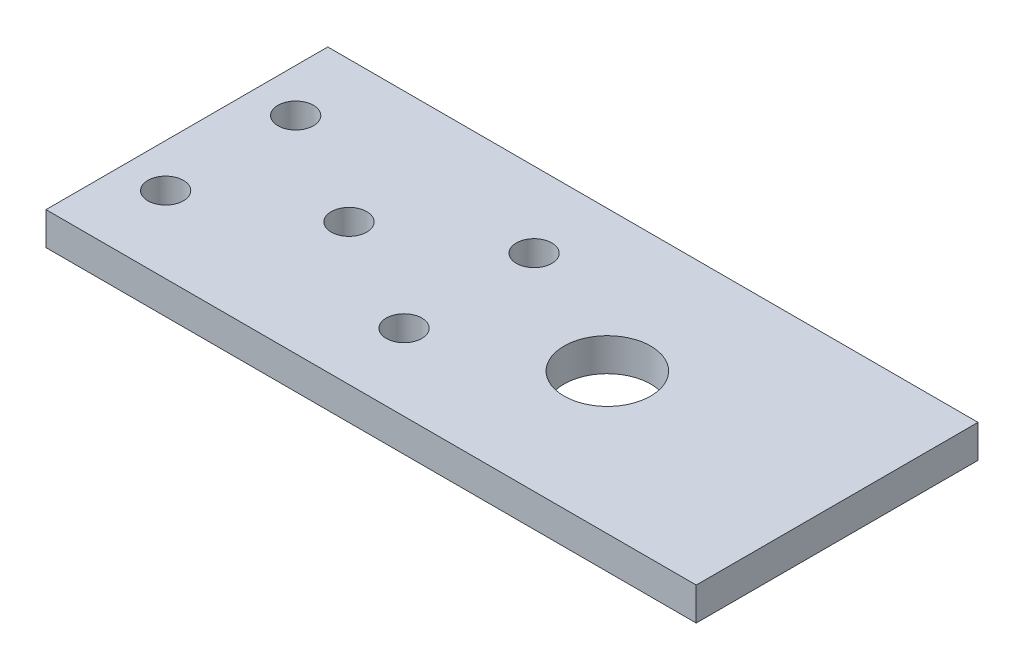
ISO-10303-21;
HEADER;
FILE_DESCRIPTION(('STEP AP214'),'2;1');
FILE_NAME('part.step','',(''),(''),'','','');
FILE_SCHEMA(('AUTOMOTIVE_DESIGN { 1 0 10303 214 1 1 1 1 }'));
ENDSEC;
DATA;
#1=APPLICATION_CONTEXT('core data for automotive mechanical design processes');
#2=APPLICATION_PROTOCOL_DEFINITION('international standard','automotive_design',2000,#1);
#3=PRODUCT_CONTEXT('',#1,'mechanical');
#4=PRODUCT('Part','Part','',(#3));
#5=PRODUCT_RELATED_PRODUCT_CATEGORY('part','',(#4));
#6=PRODUCT_DEFINITION_FORMATION('','',#4);
#7=PRODUCT_DEFINITION_CONTEXT('part definition',#1,'design');
#8=PRODUCT_DEFINITION('design','',#6,#7);
#9=PRODUCT_DEFINITION_SHAPE('','',#8);
#10=(LENGTH_UNIT() NAMED_UNIT(*) SI_UNIT(.MILLI.,.METRE.));
#11=(NAMED_UNIT(*) PLANE_ANGLE_UNIT() SI_UNIT($,.RADIAN.));
#12=(NAMED_UNIT(*) SI_UNIT($,.STERADIAN.) SOLID_ANGLE_UNIT());
#13=UNCERTAINTY_MEASURE_WITH_UNIT(LENGTH_MEASURE(1.E-05),#10,'distance_accuracy_value','');
#14=(GEOMETRIC_REPRESENTATION_CONTEXT(3) GLOBAL_UNCERTAINTY_ASSIGNED_CONTEXT((#13)) GLOBAL_UNIT_ASSIGNED_CONTEXT((#10,
#11,#12)) REPRESENTATION_CONTEXT('',''));
#15=CARTESIAN_POINT('',(0.,0.,0.));
#16=DIRECTION('',(0.,0.,1.));
#17=DIRECTION('',(1.,0.,0.));
#18=AXIS2_PLACEMENT_3D('',#15,#16,#17);
#19=CARTESIAN_POINT('',(0.,9.652,-82.55));
#20=DIRECTION('',(0.,-1.,0.));
#21=DIRECTION('',(0.,0.,-1.));
#22=AXIS2_PLACEMENT_3D('',#19,#20,#21);
#23=PLANE('',#22);
#24=CARTESIAN_POINT('',(82.55,9.652,-22.352));
#25=DIRECTION('',(0.,1.,0.));
#26=DIRECTION('',(0.,0.,1.));
#27=AXIS2_PLACEMENT_3D('',#24,#25,#26);
#28=CIRCLE('',#27,5.20700000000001);
#29=CARTESIAN_POINT('',(82.55,9.652,-17.145));
#30=VERTEX_POINT('',#29);
#31=EDGE_CURVE('E127',#30,#30,#28,.T.);
#32=ORIENTED_EDGE('',*,*,#31,.F.);
#33=EDGE_LOOP('',(#32));
#34=FACE_BOUND('',#33,.T.);
#35=CARTESIAN_POINT('',(12.7,9.652,-60.452));
#36=DIRECTION('',(0.,1.,0.));
#37=DIRECTION('',(0.,0.,1.));
#38=AXIS2_PLACEMENT_3D('',#35,#36,#37);
#39=CIRCLE('',#38,5.207);
#40=CARTESIAN_POINT('',(12.7,9.652,-55.245));
#41=VERTEX_POINT('',#40);
#42=EDGE_CURVE('E141',#41,#41,#39,.T.);
#43=ORIENTED_EDGE('',*,*,#42,.F.);
#44=EDGE_LOOP('',(#43));
#45=FACE_BOUND('',#44,.T.);
#46=CARTESIAN_POINT('',(123.19,9.652,-41.275));
#47=DIRECTION('',(0.,1.,0.));
#48=DIRECTION('',(0.,0.,1.));
#49=AXIS2_PLACEMENT_3D('',#46,#47,#48);
#50=CIRCLE('',#49,12.7);
#51=CARTESIAN_POINT('',(123.19,9.652,-28.5749999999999));
#52=VERTEX_POINT('',#51);
#53=EDGE_CURVE('E85',#52,#52,#50,.T.);
#54=ORIENTED_EDGE('',*,*,#53,.F.);
#55=EDGE_LOOP('',(#54));
#56=FACE_BOUND('',#55,.T.);
#57=DIRECTION('',(0.,0.,1.));
#58=VECTOR('',#57,1.);
#59=CARTESIAN_POINT('',(0.,9.652,0.));
#60=LINE('',#59,#58);
#61=CARTESIAN_POINT('',(0.,9.652,-82.55));
#62=VERTEX_POINT('',#61);
#63=CARTESIAN_POINT('',(0.,9.652,0.));
#64=VERTEX_POINT('',#63);
#65=EDGE_CURVE('E95',#62,#64,#60,.T.);
#66=ORIENTED_EDGE('',*,*,#65,.T.);
#67=DIRECTION('',(1.,0.,0.));
#68=VECTOR('',#67,1.);
#69=CARTESIAN_POINT('',(0.,9.652,0.));
#70=LINE('',#69,#68);
#71=CARTESIAN_POINT('',(190.5,9.652,0.));
#72=VERTEX_POINT('',#71);
#73=EDGE_CURVE('E80',#64,#72,#70,.T.);
#74=ORIENTED_EDGE('',*,*,#73,.T.);
#75=DIRECTION('',(0.,0.,-1.));
#76=VECTOR('',#75,1.);
#77=CARTESIAN_POINT('',(190.5,9.652,0.));
#78=LINE('',#77,#76);
#79=CARTESIAN_POINT('',(190.5,9.652,-82.55));
#80=VERTEX_POINT('',#79);
#81=EDGE_CURVE('E46',#72,#80,#78,.T.);
#82=ORIENTED_EDGE('',*,*,#81,.T.);
#83=DIRECTION('',(-1.,0.,0.));
#84=VECTOR('',#83,1.);
#85=CARTESIAN_POINT('',(0.,9.652,-82.55));
#86=LINE('',#85,#84);
#87=EDGE_CURVE('E41',#80,#62,#86,.T.);
#88=ORIENTED_EDGE('',*,*,#87,.T.);
#89=EDGE_LOOP('',(#66,#74,#82,#88));
#90=FACE_BOUND('',#89,.T.);
#91=CARTESIAN_POINT('',(47.498,9.652,-41.275));
#92=DIRECTION('',(0.,1.,0.));
#93=DIRECTION('',(0.,0.,1.));
#94=AXIS2_PLACEMENT_3D('',#91,#92,#93);
#95=CIRCLE('',#94,5.20700000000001);
#96=CARTESIAN_POINT('',(47.498,9.652,-36.068));
#97=VERTEX_POINT('',#96);
#98=EDGE_CURVE('E114',#97,#97,#95,.T.);
#99=ORIENTED_EDGE('',*,*,#98,.F.);
#100=EDGE_LOOP('',(#99));
#101=FACE_BOUND('',#100,.T.);
#102=CARTESIAN_POINT('',(12.7,9.652,-22.352));
#103=DIRECTION('',(0.,1.,0.));
#104=DIRECTION('',(0.,0.,1.));
#105=AXIS2_PLACEMENT_3D('',#102,#103,#104);
#106=CIRCLE('',#105,5.207);
#107=CARTESIAN_POINT('',(12.7,9.652,-17.145));
#108=VERTEX_POINT('',#107);
#109=EDGE_CURVE('E118',#108,#108,#106,.T.);
#110=ORIENTED_EDGE('',*,*,#109,.F.);
#111=EDGE_LOOP('',(#110));
#112=FACE_BOUND('',#111,.T.);
#113=CARTESIAN_POINT('',(82.55,9.652,-60.452));
#114=DIRECTION('',(0.,1.,0.));
#115=DIRECTION('',(0.,0.,1.));
#116=AXIS2_PLACEMENT_3D('',#113,#114,#115);
#117=CIRCLE('',#116,5.20700000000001);
#118=CARTESIAN_POINT('',(82.55,9.652,-55.245));
#119=VERTEX_POINT('',#118);
#120=EDGE_CURVE('E121',#119,#119,#117,.T.);
#121=ORIENTED_EDGE('',*,*,#120,.F.);
#122=EDGE_LOOP('',(#121));
#123=FACE_BOUND('',#122,.T.);
#124=ADVANCED_FACE('F26',(#34,#45,#56,#90,#101,#112,#123),#23,.F.);
#125=CARTESIAN_POINT('',(0.,0.,-82.55));
#126=DIRECTION('',(0.,-1.,0.));
#127=DIRECTION('',(0.,0.,-1.));
#128=AXIS2_PLACEMENT_3D('',#125,#126,#127);
#129=PLANE('',#128);
#130=CARTESIAN_POINT('',(82.55,0.,-22.352));
#131=DIRECTION('',(0.,1.,0.));
#132=DIRECTION('',(0.,0.,1.));
#133=AXIS2_PLACEMENT_3D('',#130,#131,#132);
#134=CIRCLE('',#133,5.20700000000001);
#135=CARTESIAN_POINT('',(82.55,0.,-17.145));
#136=VERTEX_POINT('',#135);
#137=EDGE_CURVE('E123',#136,#136,#134,.T.);
#138=ORIENTED_EDGE('',*,*,#137,.T.);
#139=EDGE_LOOP('',(#138));
#140=FACE_BOUND('',#139,.T.);
#141=CARTESIAN_POINT('',(12.7,0.,-60.452));
#142=DIRECTION('',(0.,1.,0.));
#143=DIRECTION('',(0.,0.,1.));
#144=AXIS2_PLACEMENT_3D('',#141,#142,#143);
#145=CIRCLE('',#144,5.207);
#146=CARTESIAN_POINT('',(12.7,0.,-55.245));
#147=VERTEX_POINT('',#146);
#148=EDGE_CURVE('E138',#147,#147,#145,.T.);
#149=ORIENTED_EDGE('',*,*,#148,.T.);
#150=EDGE_LOOP('',(#149));
#151=FACE_BOUND('',#150,.T.);
#152=CARTESIAN_POINT('',(123.19,0.,-41.275));
#153=DIRECTION('',(0.,1.,0.));
#154=DIRECTION('',(0.,0.,1.));
#155=AXIS2_PLACEMENT_3D('',#152,#153,#154);
#156=CIRCLE('',#155,12.7);
#157=CARTESIAN_POINT('',(123.19,0.,-28.5749999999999));
#158=VERTEX_POINT('',#157);
#159=EDGE_CURVE('E88',#158,#158,#156,.T.);
#160=ORIENTED_EDGE('',*,*,#159,.T.);
#161=EDGE_LOOP('',(#160));
#162=FACE_BOUND('',#161,.T.);
#163=DIRECTION('',(0.,0.,1.));
#164=VECTOR('',#163,1.);
#165=CARTESIAN_POINT('',(0.,0.,0.));
#166=LINE('',#165,#164);
#167=CARTESIAN_POINT('',(0.,0.,-82.55));
#168=VERTEX_POINT('',#167);
#169=CARTESIAN_POINT('',(0.,0.,0.));
#170=VERTEX_POINT('',#169);
#171=EDGE_CURVE('E72',#168,#170,#166,.T.);
#172=ORIENTED_EDGE('',*,*,#171,.F.);
#173=DIRECTION('',(-1.,0.,0.));
#174=VECTOR('',#173,1.);
#175=CARTESIAN_POINT('',(0.,0.,-82.55));
#176=LINE('',#175,#174);
#177=CARTESIAN_POINT('',(190.5,0.,-82.55));
#178=VERTEX_POINT('',#177);
#179=EDGE_CURVE('E93',#178,#168,#176,.T.);
#180=ORIENTED_EDGE('',*,*,#179,.F.);
#181=DIRECTION('',(0.,0.,-1.));
#182=VECTOR('',#181,1.);
#183=CARTESIAN_POINT('',(190.5,0.,0.));
#184=LINE('',#183,#182);
#185=CARTESIAN_POINT('',(190.5,0.,0.));
#186=VERTEX_POINT('',#185);
#187=EDGE_CURVE('E73',#186,#178,#184,.T.);
#188=ORIENTED_EDGE('',*,*,#187,.F.);
#189=DIRECTION('',(1.,0.,0.));
#190=VECTOR('',#189,1.);
#191=CARTESIAN_POINT('',(0.,0.,0.));
#192=LINE('',#191,#190);
#193=EDGE_CURVE('E67',#170,#186,#192,.T.);
#194=ORIENTED_EDGE('',*,*,#193,.F.);
#195=EDGE_LOOP('',(#172,#180,#188,#194));
#196=FACE_BOUND('',#195,.T.);
#197=CARTESIAN_POINT('',(47.498,0.,-41.275));
#198=DIRECTION('',(0.,1.,0.));
#199=DIRECTION('',(0.,0.,1.));
#200=AXIS2_PLACEMENT_3D('',#197,#198,#199);
#201=CIRCLE('',#200,5.20700000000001);
#202=CARTESIAN_POINT('',(47.498,0.,-36.068));
#203=VERTEX_POINT('',#202);
#204=EDGE_CURVE('E144',#203,#203,#201,.T.);
#205=ORIENTED_EDGE('',*,*,#204,.T.);
#206=EDGE_LOOP('',(#205));
#207=FACE_BOUND('',#206,.T.);
#208=CARTESIAN_POINT('',(12.7,0.,-22.352));
#209=DIRECTION('',(0.,1.,0.));
#210=DIRECTION('',(0.,0.,1.));
#211=AXIS2_PLACEMENT_3D('',#208,#209,#210);
#212=CIRCLE('',#211,5.207);
#213=CARTESIAN_POINT('',(12.7,0.,-17.145));
#214=VERTEX_POINT('',#213);
#215=EDGE_CURVE('E134',#214,#214,#212,.T.);
#216=ORIENTED_EDGE('',*,*,#215,.T.);
#217=EDGE_LOOP('',(#216));
#218=FACE_BOUND('',#217,.T.);
#219=CARTESIAN_POINT('',(82.55,0.,-60.452));
#220=DIRECTION('',(0.,1.,0.));
#221=DIRECTION('',(0.,0.,1.));
#222=AXIS2_PLACEMENT_3D('',#219,#220,#221);
#223=CIRCLE('',#222,5.20700000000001);
#224=CARTESIAN_POINT('',(82.55,0.,-55.245));
#225=VERTEX_POINT('',#224);
#226=EDGE_CURVE('E124',#225,#225,#223,.T.);
#227=ORIENTED_EDGE('',*,*,#226,.T.);
#228=EDGE_LOOP('',(#227));
#229=FACE_BOUND('',#228,.T.);
#230=ADVANCED_FACE('F68',(#140,#151,#162,#196,#207,#218,#229),#129,.T.);
#231=CARTESIAN_POINT('',(0.,9.652,0.));
#232=DIRECTION('',(1.,0.,0.));
#233=DIRECTION('',(0.,0.,-1.));
#234=AXIS2_PLACEMENT_3D('',#231,#232,#233);
#235=PLANE('',#234);
#236=ORIENTED_EDGE('',*,*,#171,.T.);
#237=DIRECTION('',(0.,-1.,0.));
#238=VECTOR('',#237,1.);
#239=CARTESIAN_POINT('',(0.,9.652,0.));
#240=LINE('',#239,#238);
#241=EDGE_CURVE('E11',#64,#170,#240,.T.);
#242=ORIENTED_EDGE('',*,*,#241,.F.);
#243=ORIENTED_EDGE('',*,*,#65,.F.);
#244=DIRECTION('',(0.,-1.,0.));
#245=VECTOR('',#244,1.);
#246=CARTESIAN_POINT('',(0.,9.652,-82.55));
#247=LINE('',#246,#245);
#248=EDGE_CURVE('E84',#62,#168,#247,.T.);
#249=ORIENTED_EDGE('',*,*,#248,.T.);
#250=EDGE_LOOP('',(#236,#242,#243,#249));
#251=FACE_BOUND('',#250,.T.);
#252=ADVANCED_FACE('F28',(#251),#235,.F.);
#253=CARTESIAN_POINT('',(0.,9.652,0.));
#254=DIRECTION('',(0.,0.,-1.));
#255=DIRECTION('',(-1.,0.,0.));
#256=AXIS2_PLACEMENT_3D('',#253,#254,#255);
#257=PLANE('',#256);
#258=ORIENTED_EDGE('',*,*,#193,.T.);
#259=DIRECTION('',(0.,-1.,0.));
#260=VECTOR('',#259,1.);
#261=CARTESIAN_POINT('',(190.5,9.652,0.));
#262=LINE('',#261,#260);
#263=EDGE_CURVE('E34',#72,#186,#262,.T.);
#264=ORIENTED_EDGE('',*,*,#263,.F.);
#265=ORIENTED_EDGE('',*,*,#73,.F.);
#266=ORIENTED_EDGE('',*,*,#241,.T.);
#267=EDGE_LOOP('',(#258,#264,#265,#266));
#268=FACE_BOUND('',#267,.T.);
#269=ADVANCED_FACE('F79',(#268),#257,.F.);
#270=CARTESIAN_POINT('',(190.5,9.652,0.));
#271=DIRECTION('',(-1.,0.,0.));
#272=DIRECTION('',(0.,0.,1.));
#273=AXIS2_PLACEMENT_3D('',#270,#271,#272);
#274=PLANE('',#273);
#275=ORIENTED_EDGE('',*,*,#187,.T.);
#276=DIRECTION('',(0.,-1.,0.));
#277=VECTOR('',#276,1.);
#278=CARTESIAN_POINT('',(190.5,9.652,-82.55));
#279=LINE('',#278,#277);
#280=EDGE_CURVE('E101',#80,#178,#279,.T.);
#281=ORIENTED_EDGE('',*,*,#280,.F.);
#282=ORIENTED_EDGE('',*,*,#81,.F.);
#283=ORIENTED_EDGE('',*,*,#263,.T.);
#284=EDGE_LOOP('',(#275,#281,#282,#283));
#285=FACE_BOUND('',#284,.T.);
#286=ADVANCED_FACE('F104',(#285),#274,.F.);
#287=CARTESIAN_POINT('',(0.,9.652,-82.55));
#288=DIRECTION('',(0.,0.,1.));
#289=DIRECTION('',(1.,0.,0.));
#290=AXIS2_PLACEMENT_3D('',#287,#288,#289);
#291=PLANE('',#290);
#292=ORIENTED_EDGE('',*,*,#179,.T.);
#293=ORIENTED_EDGE('',*,*,#248,.F.);
#294=ORIENTED_EDGE('',*,*,#87,.F.);
#295=ORIENTED_EDGE('',*,*,#280,.T.);
#296=EDGE_LOOP('',(#292,#293,#294,#295));
#297=FACE_BOUND('',#296,.T.);
#298=ADVANCED_FACE('F106',(#297),#291,.F.);
#299=CARTESIAN_POINT('',(123.19,9.652,-41.275));
#300=DIRECTION('',(0.,-1.,0.));
#301=DIRECTION('',(0.,0.,-1.));
#302=AXIS2_PLACEMENT_3D('',#299,#300,#301);
#303=CYLINDRICAL_SURFACE('',#302,12.7);
#304=ORIENTED_EDGE('',*,*,#53,.T.);
#305=EDGE_LOOP('',(#304));
#306=FACE_BOUND('',#305,.T.);
#307=ORIENTED_EDGE('',*,*,#159,.F.);
#308=EDGE_LOOP('',(#307));
#309=FACE_BOUND('',#308,.T.);
#310=ADVANCED_FACE('F151',(#306,#309),#303,.F.);
#311=CARTESIAN_POINT('',(47.498,9.652,-41.275));
#312=DIRECTION('',(0.,-1.,0.));
#313=DIRECTION('',(0.,0.,-1.));
#314=AXIS2_PLACEMENT_3D('',#311,#312,#313);
#315=CYLINDRICAL_SURFACE('',#314,5.20700000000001);
#316=ORIENTED_EDGE('',*,*,#98,.T.);
#317=EDGE_LOOP('',(#316));
#318=FACE_BOUND('',#317,.T.);
#319=ORIENTED_EDGE('',*,*,#204,.F.);
#320=EDGE_LOOP('',(#319));
#321=FACE_BOUND('',#320,.T.);
#322=ADVANCED_FACE('F153',(#318,#321),#315,.F.);
#323=CARTESIAN_POINT('',(12.7,9.652,-60.452));
#324=DIRECTION('',(0.,-1.,0.));
#325=DIRECTION('',(0.,0.,-1.));
#326=AXIS2_PLACEMENT_3D('',#323,#324,#325);
#327=CYLINDRICAL_SURFACE('',#326,5.207);
#328=ORIENTED_EDGE('',*,*,#42,.T.);
#329=EDGE_LOOP('',(#328));
#330=FACE_BOUND('',#329,.T.);
#331=ORIENTED_EDGE('',*,*,#148,.F.);
#332=EDGE_LOOP('',(#331));
#333=FACE_BOUND('',#332,.T.);
#334=ADVANCED_FACE('F160',(#330,#333),#327,.F.);
#335=CARTESIAN_POINT('',(12.7,9.652,-22.352));
#336=DIRECTION('',(0.,-1.,0.));
#337=DIRECTION('',(0.,0.,-1.));
#338=AXIS2_PLACEMENT_3D('',#335,#336,#337);
#339=CYLINDRICAL_SURFACE('',#338,5.207);
#340=ORIENTED_EDGE('',*,*,#109,.T.);
#341=EDGE_LOOP('',(#340));
#342=FACE_BOUND('',#341,.T.);
#343=ORIENTED_EDGE('',*,*,#215,.F.);
#344=EDGE_LOOP('',(#343));
#345=FACE_BOUND('',#344,.T.);
#346=ADVANCED_FACE('F207',(#342,#345),#339,.F.);
#347=CARTESIAN_POINT('',(82.55,9.652,-22.352));
#348=DIRECTION('',(0.,-1.,0.));
#349=DIRECTION('',(0.,0.,-1.));
#350=AXIS2_PLACEMENT_3D('',#347,#348,#349);
#351=CYLINDRICAL_SURFACE('',#350,5.20700000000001);
#352=ORIENTED_EDGE('',*,*,#31,.T.);
#353=EDGE_LOOP('',(#352));
#354=FACE_BOUND('',#353,.T.);
#355=ORIENTED_EDGE('',*,*,#137,.F.);
#356=EDGE_LOOP('',(#355));
#357=FACE_BOUND('',#356,.T.);
#358=ADVANCED_FACE('F214',(#354,#357),#351,.F.);
#359=CARTESIAN_POINT('',(82.55,9.652,-60.452));
#360=DIRECTION('',(0.,-1.,0.));
#361=DIRECTION('',(0.,0.,-1.));
#362=AXIS2_PLACEMENT_3D('',#359,#360,#361);
#363=CYLINDRICAL_SURFACE('',#362,5.20700000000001);
#364=ORIENTED_EDGE('',*,*,#120,.T.);
#365=EDGE_LOOP('',(#364));
#366=FACE_BOUND('',#365,.T.);
#367=ORIENTED_EDGE('',*,*,#226,.F.);
#368=EDGE_LOOP('',(#367));
#369=FACE_BOUND('',#368,.T.);
#370=ADVANCED_FACE('F222',(#366,#369),#363,.F.);
#371=CLOSED_SHELL('',(#124,#230,#252,#269,#286,#298,#310,#322,#334,#346,#358,#370));
#372=MANIFOLD_SOLID_BREP('B2',#371);
#373=ADVANCED_BREP_SHAPE_REPRESENTATION('',(#18,#372),#14);
#374=SHAPE_DEFINITION_REPRESENTATION(#9,#373);
ENDSEC;
END-ISO-10303-21;
